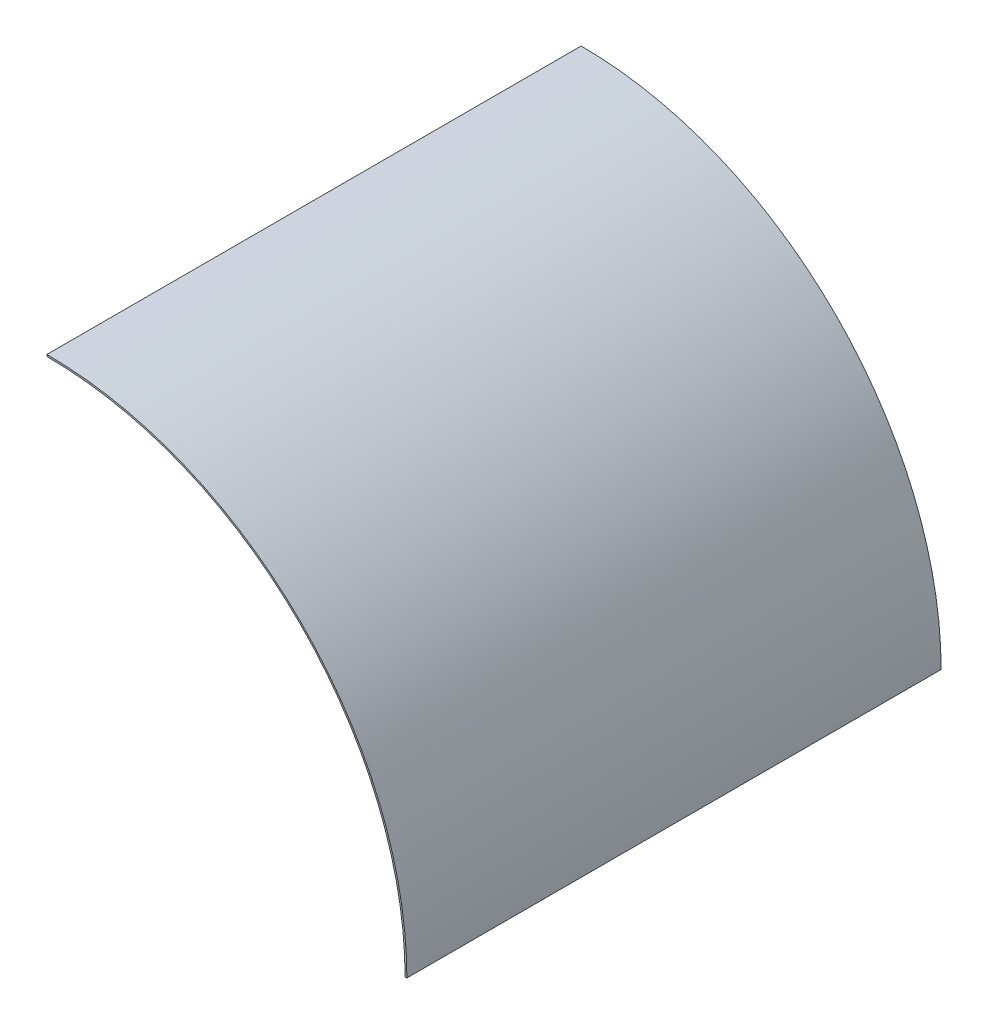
ISO-10303-21;
HEADER;
FILE_DESCRIPTION(('STEP AP214'),'2;1');
FILE_NAME('part.step','',(''),(''),'','','');
FILE_SCHEMA(('AUTOMOTIVE_DESIGN { 1 0 10303 214 1 1 1 1 }'));
ENDSEC;
DATA;
#1=APPLICATION_CONTEXT('core data for automotive mechanical design processes');
#2=APPLICATION_PROTOCOL_DEFINITION('international standard','automotive_design',2000,#1);
#3=PRODUCT_CONTEXT('',#1,'mechanical');
#4=PRODUCT('Part','Part','',(#3));
#5=PRODUCT_RELATED_PRODUCT_CATEGORY('part','',(#4));
#6=PRODUCT_DEFINITION_FORMATION('','',#4);
#7=PRODUCT_DEFINITION_CONTEXT('part definition',#1,'design');
#8=PRODUCT_DEFINITION('design','',#6,#7);
#9=PRODUCT_DEFINITION_SHAPE('','',#8);
#10=(LENGTH_UNIT() NAMED_UNIT(*) SI_UNIT(.MILLI.,.METRE.));
#11=(NAMED_UNIT(*) PLANE_ANGLE_UNIT() SI_UNIT($,.RADIAN.));
#12=(NAMED_UNIT(*) SI_UNIT($,.STERADIAN.) SOLID_ANGLE_UNIT());
#13=UNCERTAINTY_MEASURE_WITH_UNIT(LENGTH_MEASURE(1.E-05),#10,'distance_accuracy_value','');
#14=(GEOMETRIC_REPRESENTATION_CONTEXT(3) GLOBAL_UNCERTAINTY_ASSIGNED_CONTEXT((#13)) GLOBAL_UNIT_ASSIGNED_CONTEXT((#10,
#11,#12)) REPRESENTATION_CONTEXT('',''));
#15=CARTESIAN_POINT('',(0.,0.,0.));
#16=DIRECTION('',(0.,0.,1.));
#17=DIRECTION('',(1.,0.,0.));
#18=AXIS2_PLACEMENT_3D('',#15,#16,#17);
#19=CARTESIAN_POINT('',(-1.23781175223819E-13,2021.5,-3000.));
#20=DIRECTION('',(-1.,0.,0.));
#21=DIRECTION('',(0.,-1.,0.));
#22=AXIS2_PLACEMENT_3D('',#19,#20,#21);
#23=PLANE('',#22);
#24=DIRECTION('',(0.,-1.,0.));
#25=VECTOR('',#24,1.);
#26=CARTESIAN_POINT('',(-1.23781175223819E-13,2021.5,0.));
#27=LINE('',#26,#25);
#28=CARTESIAN_POINT('',(-1.23781175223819E-13,2021.5,0.));
#29=VERTEX_POINT('',#28);
#30=CARTESIAN_POINT('',(-1.23168851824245E-13,2011.5,0.));
#31=VERTEX_POINT('',#30);
#32=EDGE_CURVE('E102',#29,#31,#27,.T.);
#33=ORIENTED_EDGE('',*,*,#32,.F.);
#34=DIRECTION('',(0.,0.,1.));
#35=VECTOR('',#34,1.);
#36=CARTESIAN_POINT('',(-1.23781175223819E-13,2021.5,-3000.));
#37=LINE('',#36,#35);
#38=CARTESIAN_POINT('',(-1.23781175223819E-13,2021.5,-3000.));
#39=VERTEX_POINT('',#38);
#40=EDGE_CURVE('E11',#39,#29,#37,.T.);
#41=ORIENTED_EDGE('',*,*,#40,.F.);
#42=DIRECTION('',(0.,-1.,0.));
#43=VECTOR('',#42,1.);
#44=CARTESIAN_POINT('',(-1.23781175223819E-13,2021.5,-3000.));
#45=LINE('',#44,#43);
#46=CARTESIAN_POINT('',(-1.23168851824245E-13,2011.5,-3000.));
#47=VERTEX_POINT('',#46);
#48=EDGE_CURVE('E96',#39,#47,#45,.T.);
#49=ORIENTED_EDGE('',*,*,#48,.T.);
#50=DIRECTION('',(0.,0.,1.));
#51=VECTOR('',#50,1.);
#52=CARTESIAN_POINT('',(-1.23168851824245E-13,2011.5,-3000.));
#53=LINE('',#52,#51);
#54=EDGE_CURVE('E40',#47,#31,#53,.T.);
#55=ORIENTED_EDGE('',*,*,#54,.T.);
#56=EDGE_LOOP('',(#33,#41,#49,#55));
#57=FACE_BOUND('',#56,.T.);
#58=ADVANCED_FACE('F37',(#57),#23,.T.);
#59=CARTESIAN_POINT('',(0.,0.,-3000.));
#60=DIRECTION('',(0.,0.,1.));
#61=DIRECTION('',(1.,0.,0.));
#62=AXIS2_PLACEMENT_3D('',#59,#60,#61);
#63=CYLINDRICAL_SURFACE('',#62,2021.5);
#64=CARTESIAN_POINT('',(0.,0.,0.));
#65=DIRECTION('',(0.,0.,-1.));
#66=DIRECTION('',(-1.,0.,0.));
#67=AXIS2_PLACEMENT_3D('',#64,#65,#66);
#68=CIRCLE('',#67,2021.5);
#69=CARTESIAN_POINT('',(2021.5,2.47562350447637E-13,0.));
#70=VERTEX_POINT('',#69);
#71=EDGE_CURVE('E98',#29,#70,#68,.T.);
#72=ORIENTED_EDGE('',*,*,#71,.T.);
#73=DIRECTION('',(0.,0.,1.));
#74=VECTOR('',#73,1.);
#75=CARTESIAN_POINT('',(2021.5,2.47562350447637E-13,-3000.));
#76=LINE('',#75,#74);
#77=CARTESIAN_POINT('',(2021.5,2.47562350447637E-13,-3000.));
#78=VERTEX_POINT('',#77);
#79=EDGE_CURVE('E46',#78,#70,#76,.T.);
#80=ORIENTED_EDGE('',*,*,#79,.F.);
#81=CARTESIAN_POINT('',(0.,0.,-3000.));
#82=DIRECTION('',(0.,0.,-1.));
#83=DIRECTION('',(-1.,0.,0.));
#84=AXIS2_PLACEMENT_3D('',#81,#82,#83);
#85=CIRCLE('',#84,2021.5);
#86=EDGE_CURVE('E93',#39,#78,#85,.T.);
#87=ORIENTED_EDGE('',*,*,#86,.F.);
#88=ORIENTED_EDGE('',*,*,#40,.T.);
#89=EDGE_LOOP('',(#72,#80,#87,#88));
#90=FACE_BOUND('',#89,.T.);
#91=ADVANCED_FACE('F109',(#90),#63,.T.);
#92=CARTESIAN_POINT('',(2011.5,1.23168851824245E-13,-3000.));
#93=DIRECTION('',(0.,-1.,0.));
#94=DIRECTION('',(1.,0.,0.));
#95=AXIS2_PLACEMENT_3D('',#92,#93,#94);
#96=PLANE('',#95);
#97=DIRECTION('',(1.,0.,0.));
#98=VECTOR('',#97,1.);
#99=CARTESIAN_POINT('',(2011.5,1.23168851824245E-13,0.));
#100=LINE('',#99,#98);
#101=CARTESIAN_POINT('',(2011.5,1.23168851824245E-13,0.));
#102=VERTEX_POINT('',#101);
#103=EDGE_CURVE('E87',#102,#70,#100,.T.);
#104=ORIENTED_EDGE('',*,*,#103,.F.);
#105=DIRECTION('',(0.,0.,1.));
#106=VECTOR('',#105,1.);
#107=CARTESIAN_POINT('',(2011.5,1.23168851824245E-13,-3000.));
#108=LINE('',#107,#106);
#109=CARTESIAN_POINT('',(2011.5,1.23168851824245E-13,-3000.));
#110=VERTEX_POINT('',#109);
#111=EDGE_CURVE('E82',#110,#102,#108,.T.);
#112=ORIENTED_EDGE('',*,*,#111,.F.);
#113=DIRECTION('',(1.,0.,0.));
#114=VECTOR('',#113,1.);
#115=CARTESIAN_POINT('',(2011.5,1.23168851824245E-13,-3000.));
#116=LINE('',#115,#114);
#117=EDGE_CURVE('E85',#110,#78,#116,.T.);
#118=ORIENTED_EDGE('',*,*,#117,.T.);
#119=ORIENTED_EDGE('',*,*,#79,.T.);
#120=EDGE_LOOP('',(#104,#112,#118,#119));
#121=FACE_BOUND('',#120,.T.);
#122=ADVANCED_FACE('F84',(#121),#96,.T.);
#123=CARTESIAN_POINT('',(0.,0.,-3000.));
#124=DIRECTION('',(0.,0.,1.));
#125=DIRECTION('',(1.,0.,0.));
#126=AXIS2_PLACEMENT_3D('',#123,#124,#125);
#127=CYLINDRICAL_SURFACE('',#126,2011.5);
#128=CARTESIAN_POINT('',(0.,0.,0.));
#129=DIRECTION('',(0.,0.,-1.));
#130=DIRECTION('',(-1.,0.,0.));
#131=AXIS2_PLACEMENT_3D('',#128,#129,#130);
#132=CIRCLE('',#131,2011.5);
#133=EDGE_CURVE('E105',#31,#102,#132,.T.);
#134=ORIENTED_EDGE('',*,*,#133,.F.);
#135=ORIENTED_EDGE('',*,*,#54,.F.);
#136=CARTESIAN_POINT('',(0.,0.,-3000.));
#137=DIRECTION('',(0.,0.,-1.));
#138=DIRECTION('',(-1.,0.,0.));
#139=AXIS2_PLACEMENT_3D('',#136,#137,#138);
#140=CIRCLE('',#139,2011.5);
#141=EDGE_CURVE('E92',#47,#110,#140,.T.);
#142=ORIENTED_EDGE('',*,*,#141,.T.);
#143=ORIENTED_EDGE('',*,*,#111,.T.);
#144=EDGE_LOOP('',(#134,#135,#142,#143));
#145=FACE_BOUND('',#144,.T.);
#146=ADVANCED_FACE('F95',(#145),#127,.F.);
#147=CARTESIAN_POINT('',(0.,0.,-3000.));
#148=DIRECTION('',(0.,0.,-1.));
#149=DIRECTION('',(-1.,0.,0.));
#150=AXIS2_PLACEMENT_3D('',#147,#148,#149);
#151=PLANE('',#150);
#152=ORIENTED_EDGE('',*,*,#48,.F.);
#153=ORIENTED_EDGE('',*,*,#86,.T.);
#154=ORIENTED_EDGE('',*,*,#117,.F.);
#155=ORIENTED_EDGE('',*,*,#141,.F.);
#156=EDGE_LOOP('',(#152,#153,#154,#155));
#157=FACE_BOUND('',#156,.T.);
#158=ADVANCED_FACE('F91',(#157),#151,.T.);
#159=CARTESIAN_POINT('',(0.,0.,0.));
#160=DIRECTION('',(0.,0.,-1.));
#161=DIRECTION('',(-1.,0.,0.));
#162=AXIS2_PLACEMENT_3D('',#159,#160,#161);
#163=PLANE('',#162);
#164=ORIENTED_EDGE('',*,*,#32,.T.);
#165=ORIENTED_EDGE('',*,*,#133,.T.);
#166=ORIENTED_EDGE('',*,*,#103,.T.);
#167=ORIENTED_EDGE('',*,*,#71,.F.);
#168=EDGE_LOOP('',(#164,#165,#166,#167));
#169=FACE_BOUND('',#168,.T.);
#170=ADVANCED_FACE('F111',(#169),#163,.F.);
#171=CLOSED_SHELL('',(#58,#91,#122,#146,#158,#170));
#172=MANIFOLD_SOLID_BREP('B2',#171);
#173=ADVANCED_BREP_SHAPE_REPRESENTATION('',(#18,#172),#14);
#174=SHAPE_DEFINITION_REPRESENTATION(#9,#173);
ENDSEC;
END-ISO-10303-21;
